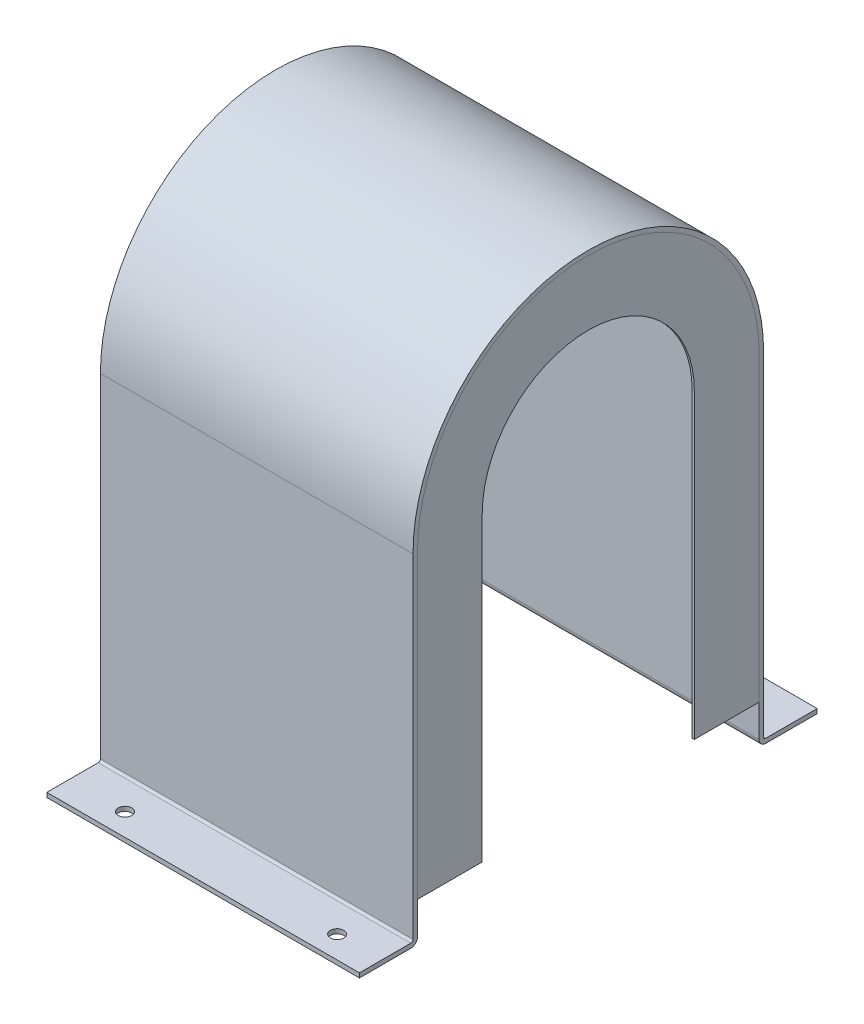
from build123d import *

# Parameters (mm, degrees)
BOSS_EXTRUDE1_DEPTH = 140
SKETCH2_R           = 95
BOSS_EXTRUDE2_DEPTH = 2
SKETCH3_R           = 6
CUT_EXTRUDE1_DEPTH  = 521.950093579
SKETCH4_W           = 190
SKETCH4_H           = 270
CUT_EXTRUDE2_DEPTH  = 463.006493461


with BuildPart() as part:
    # Sketch1 → Boss-Extrude1 (new, symmetric)
    with BuildSketch(Plane(origin=(0, 0, 0), x_dir=(0, 0, -1), z_dir=(1, 0, 0))):
        with BuildLine():
            Line((157, 0), (157, -299))
            ThreePointArc((157, -299), (157.585786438, -300.414213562), (159, -301))
            Line((159, -301), (205, -301))
            Line((205, -301), (205, -305))
            Line((205, -305), (159, -305))
            ThreePointArc((159, -305), (154.757359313, -303.242640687), (153, -299))
            Line((153, -299), (153, 0))
            ThreePointArc((153, 0), (0, 153), (-153, 0))
            Line((-153, 0), (-153, -299))
            ThreePointArc((-153, -299), (-154.757359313, -303.242640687), (-159, -305))
            Line((-159, -305), (-205, -305))
            Line((-205, -305), (-205, -301))
            Line((-205, -301), (-159, -301))
            ThreePointArc((-159, -301), (-157.585786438, -300.414213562), (-157, -299))
            Line((-157, -299), (-157, 0))
            ThreePointArc((-157, 0), (0, 157), (157, 0))
        make_face()
    extrude(amount=BOSS_EXTRUDE1_DEPTH, both=True)

    # Sketch3 → Cut-Extrude1 (cut, through all)
    with BuildSketch(Plane(origin=(0, -301, 0), x_dir=(1, 0, 0), z_dir=(0, 1, 0))):
        with Locations(Location((-90, -185, 0), (0, 0, 270))):
            Circle(SKETCH3_R)
        with Locations(Location((100, -185, 0), (0, 0, 270))):
            Circle(SKETCH3_R)
    cut_extrude1 = extrude(amount=-CUT_EXTRUDE1_DEPTH, mode=Mode.SUBTRACT)

    # Mirror5: Cut-Extrude1 across plane
    add(cut_extrude1.mirror(Plane.XY), mode=Mode.SUBTRACT)


with BuildPart() as body_2:
    # Sketch2 → Boss-Extrude2 (new body)
    with BuildSketch(Plane(origin=(140, 0, 0), x_dir=(0, 0, -1), z_dir=(1, 0, 0))):
        with BuildLine():
            Line((-153, 0), (-153, -270))
            Line((-153, -270), (153, -270))
            Line((153, -270), (153, 0))
            ThreePointArc((153, 0), (0, 153), (-153, 0))
        make_face()
        Circle(SKETCH2_R, mode=Mode.SUBTRACT)
    extrude(amount=-BOSS_EXTRUDE2_DEPTH)


with BuildPart() as body_3:
    # Mirror4: mirrored copy
    add(body_2.part.mirror(Plane(origin=(0, 0, 0), x_dir=(0, 0, 1), z_dir=(1, 0, 0))))


with BuildPart() as cut_extrude2_tool:
    # Sketch4 → Cut-Extrude2 (new, through all)
    with BuildSketch(Plane.ZY.offset(140)):
        with Locations((0, -135)):
            Rectangle(SKETCH4_W, SKETCH4_H)
    extrude(amount=-CUT_EXTRUDE2_DEPTH)


with BuildPart() as body_2_1:
    add(body_2.part)

    # Cut-Extrude2: cut by cut_extrude2_tool
    add(cut_extrude2_tool.part, mode=Mode.SUBTRACT)


with BuildPart() as body_3_1:
    add(body_3.part)

    # Cut-Extrude2: cut by cut_extrude2_tool
    add(cut_extrude2_tool.part, mode=Mode.SUBTRACT)


solid = Compound([part.part, body_2_1.part, body_3_1.part])
